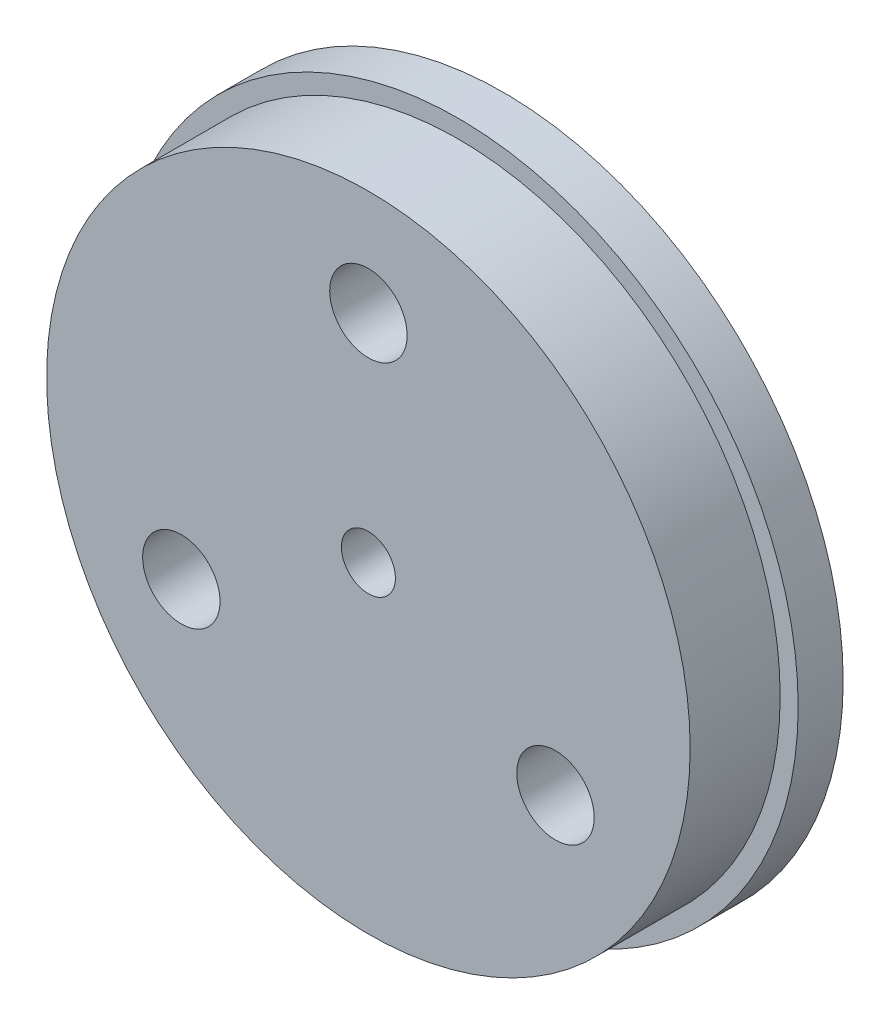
ISO-10303-21;
HEADER;
FILE_DESCRIPTION(('STEP AP214'),'2;1');
FILE_NAME('part.step','',(''),(''),'','','');
FILE_SCHEMA(('AUTOMOTIVE_DESIGN { 1 0 10303 214 1 1 1 1 }'));
ENDSEC;
DATA;
#1=APPLICATION_CONTEXT('core data for automotive mechanical design processes');
#2=APPLICATION_PROTOCOL_DEFINITION('international standard','automotive_design',2000,#1);
#3=PRODUCT_CONTEXT('',#1,'mechanical');
#4=PRODUCT('Part','Part','',(#3));
#5=PRODUCT_RELATED_PRODUCT_CATEGORY('part','',(#4));
#6=PRODUCT_DEFINITION_FORMATION('','',#4);
#7=PRODUCT_DEFINITION_CONTEXT('part definition',#1,'design');
#8=PRODUCT_DEFINITION('design','',#6,#7);
#9=PRODUCT_DEFINITION_SHAPE('','',#8);
#10=(LENGTH_UNIT() NAMED_UNIT(*) SI_UNIT(.MILLI.,.METRE.));
#11=(NAMED_UNIT(*) PLANE_ANGLE_UNIT() SI_UNIT($,.RADIAN.));
#12=(NAMED_UNIT(*) SI_UNIT($,.STERADIAN.) SOLID_ANGLE_UNIT());
#13=UNCERTAINTY_MEASURE_WITH_UNIT(LENGTH_MEASURE(1.E-05),#10,'distance_accuracy_value','');
#14=(GEOMETRIC_REPRESENTATION_CONTEXT(3) GLOBAL_UNCERTAINTY_ASSIGNED_CONTEXT((#13)) GLOBAL_UNIT_ASSIGNED_CONTEXT((#10,
#11,#12)) REPRESENTATION_CONTEXT('',''));
#15=CARTESIAN_POINT('',(0.,0.,0.));
#16=DIRECTION('',(0.,0.,1.));
#17=DIRECTION('',(1.,0.,0.));
#18=AXIS2_PLACEMENT_3D('',#15,#16,#17);
#19=CARTESIAN_POINT('',(0.,24.,5.));
#20=DIRECTION('',(0.,0.,-1.));
#21=DIRECTION('',(-1.,0.,0.));
#22=AXIS2_PLACEMENT_3D('',#19,#20,#21);
#23=CYLINDRICAL_SURFACE('',#22,4.3);
#24=CARTESIAN_POINT('',(0.,24.,15.));
#25=DIRECTION('',(0.,0.,1.));
#26=DIRECTION('',(1.,0.,0.));
#27=AXIS2_PLACEMENT_3D('',#24,#25,#26);
#28=CIRCLE('',#27,4.3);
#29=CARTESIAN_POINT('',(4.3,24.,15.));
#30=VERTEX_POINT('',#29);
#31=EDGE_CURVE('E210',#30,#30,#28,.T.);
#32=ORIENTED_EDGE('',*,*,#31,.T.);
#33=EDGE_LOOP('',(#32));
#34=FACE_BOUND('',#33,.T.);
#35=CARTESIAN_POINT('',(0.,24.,1.5));
#36=DIRECTION('',(0.,0.,-1.));
#37=DIRECTION('',(-1.,0.,0.));
#38=AXIS2_PLACEMENT_3D('',#35,#36,#37);
#39=CIRCLE('',#38,4.3);
#40=CARTESIAN_POINT('',(-4.3,24.,1.5));
#41=VERTEX_POINT('',#40);
#42=EDGE_CURVE('E368',#41,#41,#39,.T.);
#43=ORIENTED_EDGE('',*,*,#42,.T.);
#44=EDGE_LOOP('',(#43));
#45=FACE_BOUND('',#44,.T.);
#46=ADVANCED_FACE('F42',(#34,#45),#23,.F.);
#47=CARTESIAN_POINT('',(20.7846096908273,-11.9999999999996,5.));
#48=DIRECTION('',(0.,0.,-1.));
#49=DIRECTION('',(-1.,0.,0.));
#50=AXIS2_PLACEMENT_3D('',#47,#48,#49);
#51=CYLINDRICAL_SURFACE('',#50,4.3);
#52=CARTESIAN_POINT('',(20.7846096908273,-11.9999999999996,15.));
#53=DIRECTION('',(0.,0.,1.));
#54=DIRECTION('',(1.,0.,0.));
#55=AXIS2_PLACEMENT_3D('',#52,#53,#54);
#56=CIRCLE('',#55,4.3);
#57=CARTESIAN_POINT('',(25.0846096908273,-11.9999999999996,15.));
#58=VERTEX_POINT('',#57);
#59=EDGE_CURVE('E279',#58,#58,#56,.T.);
#60=ORIENTED_EDGE('',*,*,#59,.T.);
#61=EDGE_LOOP('',(#60));
#62=FACE_BOUND('',#61,.T.);
#63=CARTESIAN_POINT('',(20.7846096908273,-11.9999999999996,1.5));
#64=DIRECTION('',(0.,0.,-1.));
#65=DIRECTION('',(-1.,0.,0.));
#66=AXIS2_PLACEMENT_3D('',#63,#64,#65);
#67=CIRCLE('',#66,4.3);
#68=CARTESIAN_POINT('',(16.4846096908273,-11.9999999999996,1.5));
#69=VERTEX_POINT('',#68);
#70=EDGE_CURVE('E359',#69,#69,#67,.T.);
#71=ORIENTED_EDGE('',*,*,#70,.T.);
#72=EDGE_LOOP('',(#71));
#73=FACE_BOUND('',#72,.T.);
#74=ADVANCED_FACE('F402',(#62,#73),#51,.F.);
#75=CARTESIAN_POINT('',(-20.7846096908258,-12.0000000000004,5.));
#76=DIRECTION('',(0.,0.,-1.));
#77=DIRECTION('',(-1.,0.,0.));
#78=AXIS2_PLACEMENT_3D('',#75,#76,#77);
#79=CYLINDRICAL_SURFACE('',#78,4.3);
#80=CARTESIAN_POINT('',(-20.7846096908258,-12.0000000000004,15.));
#81=DIRECTION('',(0.,0.,1.));
#82=DIRECTION('',(1.,0.,0.));
#83=AXIS2_PLACEMENT_3D('',#80,#81,#82);
#84=CIRCLE('',#83,4.3);
#85=CARTESIAN_POINT('',(-16.4846096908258,-12.0000000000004,15.));
#86=VERTEX_POINT('',#85);
#87=EDGE_CURVE('E282',#86,#86,#84,.T.);
#88=ORIENTED_EDGE('',*,*,#87,.T.);
#89=EDGE_LOOP('',(#88));
#90=FACE_BOUND('',#89,.T.);
#91=CARTESIAN_POINT('',(-20.7846096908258,-12.0000000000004,1.5));
#92=DIRECTION('',(0.,0.,-1.));
#93=DIRECTION('',(-1.,0.,0.));
#94=AXIS2_PLACEMENT_3D('',#91,#92,#93);
#95=CIRCLE('',#94,4.3);
#96=CARTESIAN_POINT('',(-25.0846096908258,-12.0000000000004,1.5));
#97=VERTEX_POINT('',#96);
#98=EDGE_CURVE('E328',#97,#97,#95,.T.);
#99=ORIENTED_EDGE('',*,*,#98,.T.);
#100=EDGE_LOOP('',(#99));
#101=FACE_BOUND('',#100,.T.);
#102=ADVANCED_FACE('F409',(#90,#101),#79,.F.);
#103=CARTESIAN_POINT('',(-20.7846096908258,-12.0000000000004,3.));
#104=DIRECTION('',(0.,0.,-1.));
#105=DIRECTION('',(-1.,0.,0.));
#106=AXIS2_PLACEMENT_3D('',#103,#104,#105);
#107=CYLINDRICAL_SURFACE('',#106,8.5);
#108=CARTESIAN_POINT('',(-20.7846096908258,-12.0000000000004,1.5));
#109=DIRECTION('',(0.,0.,-1.));
#110=DIRECTION('',(-1.,0.,0.));
#111=AXIS2_PLACEMENT_3D('',#108,#109,#110);
#112=CIRCLE('',#111,8.5);
#113=CARTESIAN_POINT('',(-29.161889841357,-13.439158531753,1.5));
#114=VERTEX_POINT('',#113);
#115=CARTESIAN_POINT('',(-23.656603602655,-3.99989681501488,1.5));
#116=VERTEX_POINT('',#115);
#117=EDGE_CURVE('E310',#114,#116,#112,.T.);
#118=ORIENTED_EDGE('',*,*,#117,.F.);
#119=DIRECTION('',(0.,0.,-1.));
#120=VECTOR('',#119,1.);
#121=CARTESIAN_POINT('',(-29.161889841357,-13.439158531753,3.));
#122=LINE('',#121,#120);
#123=CARTESIAN_POINT('',(-29.161889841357,-13.439158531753,3.));
#124=VERTEX_POINT('',#123);
#125=EDGE_CURVE('E246',#124,#114,#122,.T.);
#126=ORIENTED_EDGE('',*,*,#125,.F.);
#127=CARTESIAN_POINT('',(-20.7846096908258,-12.0000000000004,3.));
#128=DIRECTION('',(0.,0.,1.));
#129=DIRECTION('',(-1.,0.,0.));
#130=AXIS2_PLACEMENT_3D('',#127,#128,#129);
#131=CIRCLE('',#130,8.5);
#132=CARTESIAN_POINT('',(-23.656603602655,-3.99989681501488,3.));
#133=VERTEX_POINT('',#132);
#134=EDGE_CURVE('E263',#133,#124,#131,.T.);
#135=ORIENTED_EDGE('',*,*,#134,.F.);
#136=DIRECTION('',(0.,0.,-1.));
#137=VECTOR('',#136,1.);
#138=CARTESIAN_POINT('',(-23.656603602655,-3.99989681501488,3.));
#139=LINE('',#138,#137);
#140=EDGE_CURVE('E255',#133,#116,#139,.T.);
#141=ORIENTED_EDGE('',*,*,#140,.T.);
#142=EDGE_LOOP('',(#118,#126,#135,#141));
#143=FACE_BOUND('',#142,.T.);
#144=ADVANCED_FACE('F314',(#143),#107,.T.);
#145=CARTESIAN_POINT('',(-1.74339709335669E-12,24.,3.));
#146=DIRECTION('',(0.,0.,-1.));
#147=DIRECTION('',(-1.,0.,0.));
#148=AXIS2_PLACEMENT_3D('',#145,#146,#147);
#149=CYLINDRICAL_SURFACE('',#148,8.54882869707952);
#150=CARTESIAN_POINT('',(-1.74339709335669E-12,24.,1.5));
#151=DIRECTION('',(0.,0.,-1.));
#152=DIRECTION('',(-1.,0.,0.));
#153=AXIS2_PLACEMENT_3D('',#150,#151,#152);
#154=CIRCLE('',#153,8.54882869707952);
#155=CARTESIAN_POINT('',(2.96694632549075,32.0174622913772,1.5));
#156=VERTEX_POINT('',#155);
#157=CARTESIAN_POINT('',(8.4204210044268,22.5238624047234,1.5));
#158=VERTEX_POINT('',#157);
#159=EDGE_CURVE('E358',#156,#158,#154,.T.);
#160=ORIENTED_EDGE('',*,*,#159,.F.);
#161=DIRECTION('',(0.,0.,-1.));
#162=VECTOR('',#161,1.);
#163=CARTESIAN_POINT('',(2.96694632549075,32.0174622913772,3.));
#164=LINE('',#163,#162);
#165=CARTESIAN_POINT('',(2.96694632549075,32.0174622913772,3.));
#166=VERTEX_POINT('',#165);
#167=EDGE_CURVE('E217',#166,#156,#164,.T.);
#168=ORIENTED_EDGE('',*,*,#167,.F.);
#169=CARTESIAN_POINT('',(-1.74339709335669E-12,24.,3.));
#170=DIRECTION('',(0.,0.,1.));
#171=DIRECTION('',(-1.,0.,0.));
#172=AXIS2_PLACEMENT_3D('',#169,#170,#171);
#173=CIRCLE('',#172,8.54882869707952);
#174=CARTESIAN_POINT('',(8.4204210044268,22.5238624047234,3.));
#175=VERTEX_POINT('',#174);
#176=EDGE_CURVE('E233',#175,#166,#173,.T.);
#177=ORIENTED_EDGE('',*,*,#176,.F.);
#178=DIRECTION('',(0.,0.,-1.));
#179=VECTOR('',#178,1.);
#180=CARTESIAN_POINT('',(8.4204210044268,22.5238624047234,3.));
#181=LINE('',#180,#179);
#182=EDGE_CURVE('E226',#175,#158,#181,.T.);
#183=ORIENTED_EDGE('',*,*,#182,.T.);
#184=EDGE_LOOP('',(#160,#168,#177,#183));
#185=FACE_BOUND('',#184,.T.);
#186=ADVANCED_FACE('F475',(#185),#149,.T.);
#187=CARTESIAN_POINT('',(20.7846096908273,-11.9999999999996,3.));
#188=DIRECTION('',(0.,0.,-1.));
#189=DIRECTION('',(-1.,0.,0.));
#190=AXIS2_PLACEMENT_3D('',#187,#188,#189);
#191=CYLINDRICAL_SURFACE('',#190,8.5);
#192=CARTESIAN_POINT('',(20.7846096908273,-11.9999999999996,1.5));
#193=DIRECTION('',(0.,0.,-1.));
#194=DIRECTION('',(-1.,0.,0.));
#195=AXIS2_PLACEMENT_3D('',#192,#193,#194);
#196=CIRCLE('',#195,8.5);
#197=CARTESIAN_POINT('',(26.2483043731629,-18.5113777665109,1.5));
#198=VERTEX_POINT('',#197);
#199=CARTESIAN_POINT('',(15.3209150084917,-18.5113777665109,1.5));
#200=VERTEX_POINT('',#199);
#201=EDGE_CURVE('E355',#198,#200,#196,.T.);
#202=ORIENTED_EDGE('',*,*,#201,.F.);
#203=DIRECTION('',(0.,0.,-1.));
#204=VECTOR('',#203,1.);
#205=CARTESIAN_POINT('',(26.2483043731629,-18.5113777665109,3.));
#206=LINE('',#205,#204);
#207=CARTESIAN_POINT('',(26.2483043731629,-18.5113777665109,3.));
#208=VERTEX_POINT('',#207);
#209=EDGE_CURVE('E215',#208,#198,#206,.T.);
#210=ORIENTED_EDGE('',*,*,#209,.F.);
#211=CARTESIAN_POINT('',(20.7846096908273,-11.9999999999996,3.));
#212=DIRECTION('',(0.,0.,1.));
#213=DIRECTION('',(-1.,0.,0.));
#214=AXIS2_PLACEMENT_3D('',#211,#212,#213);
#215=CIRCLE('',#214,8.5);
#216=CARTESIAN_POINT('',(15.3209150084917,-18.5113777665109,3.));
#217=VERTEX_POINT('',#216);
#218=EDGE_CURVE('E206',#217,#208,#215,.T.);
#219=ORIENTED_EDGE('',*,*,#218,.F.);
#220=DIRECTION('',(0.,0.,-1.));
#221=VECTOR('',#220,1.);
#222=CARTESIAN_POINT('',(15.3209150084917,-18.5113777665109,3.));
#223=LINE('',#222,#221);
#224=EDGE_CURVE('E207',#217,#200,#223,.T.);
#225=ORIENTED_EDGE('',*,*,#224,.T.);
#226=EDGE_LOOP('',(#202,#210,#219,#225));
#227=FACE_BOUND('',#226,.T.);
#228=ADVANCED_FACE('F353',(#227),#191,.T.);
#229=CARTESIAN_POINT('',(0.,0.,5.));
#230=DIRECTION('',(0.,0.,1.));
#231=DIRECTION('',(1.,0.,0.));
#232=AXIS2_PLACEMENT_3D('',#229,#230,#231);
#233=PLANE('',#232);
#234=CARTESIAN_POINT('',(0.,0.,5.));
#235=DIRECTION('',(0.,0.,1.));
#236=DIRECTION('',(1.,0.,0.));
#237=AXIS2_PLACEMENT_3D('',#234,#235,#236);
#238=CIRCLE('',#237,35.75);
#239=CARTESIAN_POINT('',(35.75,0.,5.));
#240=VERTEX_POINT('',#239);
#241=EDGE_CURVE('E292',#240,#240,#238,.T.);
#242=ORIENTED_EDGE('',*,*,#241,.F.);
#243=EDGE_LOOP('',(#242));
#244=FACE_BOUND('',#243,.T.);
#245=CARTESIAN_POINT('',(0.,0.,5.));
#246=DIRECTION('',(0.,0.,1.));
#247=DIRECTION('',(1.,0.,0.));
#248=AXIS2_PLACEMENT_3D('',#245,#246,#247);
#249=CIRCLE('',#248,37.75);
#250=CARTESIAN_POINT('',(37.75,0.,5.));
#251=VERTEX_POINT('',#250);
#252=EDGE_CURVE('E295',#251,#251,#249,.T.);
#253=ORIENTED_EDGE('',*,*,#252,.T.);
#254=EDGE_LOOP('',(#253));
#255=FACE_BOUND('',#254,.T.);
#256=ADVANCED_FACE('F420',(#244,#255),#233,.T.);
#257=CARTESIAN_POINT('',(0.,0.,0.));
#258=DIRECTION('',(0.,0.,1.));
#259=DIRECTION('',(1.,0.,0.));
#260=AXIS2_PLACEMENT_3D('',#257,#258,#259);
#261=PLANE('',#260);
#262=DIRECTION('',(0.642787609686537,-0.76604444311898,0.));
#263=VECTOR('',#262,1.);
#264=CARTESIAN_POINT('',(27.3731826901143,-19.8519555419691,0.));
#265=LINE('',#264,#263);
#266=CARTESIAN_POINT('',(26.4090012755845,-18.7028888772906,0.));
#267=VERTEX_POINT('',#266);
#268=CARTESIAN_POINT('',(27.3731826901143,-19.8519555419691,0.));
#269=VERTEX_POINT('',#268);
#270=EDGE_CURVE('E184',#267,#269,#265,.T.);
#271=ORIENTED_EDGE('',*,*,#270,.F.);
#272=CARTESIAN_POINT('',(20.7846096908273,-11.9999999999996,0.));
#273=DIRECTION('',(0.,0.,-1.));
#274=DIRECTION('',(-1.,0.,0.));
#275=AXIS2_PLACEMENT_3D('',#272,#273,#274);
#276=CIRCLE('',#275,8.75);
#277=CARTESIAN_POINT('',(15.1602181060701,-18.7028888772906,0.));
#278=VERTEX_POINT('',#277);
#279=EDGE_CURVE('E167',#278,#267,#276,.T.);
#280=ORIENTED_EDGE('',*,*,#279,.F.);
#281=DIRECTION('',(0.642787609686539,0.766044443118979,0.));
#282=VECTOR('',#281,1.);
#283=CARTESIAN_POINT('',(14.1960366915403,-19.8519555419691,0.));
#284=LINE('',#283,#282);
#285=CARTESIAN_POINT('',(14.1960366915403,-19.8519555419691,0.));
#286=VERTEX_POINT('',#285);
#287=EDGE_CURVE('E197',#286,#278,#284,.T.);
#288=ORIENTED_EDGE('',*,*,#287,.F.);
#289=CARTESIAN_POINT('',(20.7846096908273,-11.9999999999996,0.));
#290=DIRECTION('',(0.,0.,-1.));
#291=DIRECTION('',(-1.,0.,0.));
#292=AXIS2_PLACEMENT_3D('',#289,#290,#291);
#293=CIRCLE('',#292,10.25);
#294=EDGE_CURVE('E194',#269,#286,#293,.T.);
#295=ORIENTED_EDGE('',*,*,#294,.F.);
#296=EDGE_LOOP('',(#271,#280,#288,#295));
#297=FACE_BOUND('',#296,.T.);
#298=DIRECTION('',(0.342020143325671,0.939692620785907,0.));
#299=VECTOR('',#298,1.);
#300=CARTESIAN_POINT('',(3.554535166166,33.631849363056,0.));
#301=LINE('',#300,#299);
#302=CARTESIAN_POINT('',(3.03575193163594,32.206504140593,0.));
#303=VERTEX_POINT('',#302);
#304=CARTESIAN_POINT('',(3.554535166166,33.631849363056,0.));
#305=VERTEX_POINT('',#304);
#306=EDGE_CURVE('E195',#303,#305,#301,.T.);
#307=ORIENTED_EDGE('',*,*,#306,.F.);
#308=CARTESIAN_POINT('',(-8.79504802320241E-13,24.0000000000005,0.));
#309=DIRECTION('',(0.,0.,-1.));
#310=DIRECTION('',(-1.,0.,0.));
#311=AXIS2_PLACEMENT_3D('',#308,#309,#310);
#312=CIRCLE('',#311,8.75);
#313=CARTESIAN_POINT('',(8.61853615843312,22.4889293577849,0.));
#314=VERTEX_POINT('',#313);
#315=EDGE_CURVE('E180',#314,#303,#312,.T.);
#316=ORIENTED_EDGE('',*,*,#315,.F.);
#317=DIRECTION('',(-0.984807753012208,0.17364817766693,0.));
#318=VECTOR('',#317,1.);
#319=CARTESIAN_POINT('',(10.143108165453,22.2201061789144,0.));
#320=LINE('',#319,#318);
#321=CARTESIAN_POINT('',(10.143108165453,22.2201061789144,0.));
#322=VERTEX_POINT('',#321);
#323=EDGE_CURVE('E230',#322,#314,#320,.T.);
#324=ORIENTED_EDGE('',*,*,#323,.F.);
#325=CARTESIAN_POINT('',(0.0488286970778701,24.0000000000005,0.));
#326=DIRECTION('',(0.,0.,-1.));
#327=DIRECTION('',(-1.,0.,0.));
#328=AXIS2_PLACEMENT_3D('',#325,#326,#327);
#329=CIRCLE('',#328,10.25);
#330=EDGE_CURVE('E199',#305,#322,#329,.T.);
#331=ORIENTED_EDGE('',*,*,#330,.F.);
#332=EDGE_LOOP('',(#307,#316,#324,#331));
#333=FACE_BOUND('',#332,.T.);
#334=DIRECTION('',(-0.984807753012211,-0.173648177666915,0.));
#335=VECTOR('',#334,1.);
#336=CARTESIAN_POINT('',(-30.8544748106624,-13.7376069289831,0.));
#337=LINE('',#336,#335);
#338=CARTESIAN_POINT('',(-29.4080940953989,-13.4825709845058,0.));
#339=VERTEX_POINT('',#338);
#340=CARTESIAN_POINT('',(-30.8544748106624,-13.7376069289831,0.));
#341=VERTEX_POINT('',#340);
#342=EDGE_CURVE('E229',#339,#341,#337,.T.);
#343=ORIENTED_EDGE('',*,*,#342,.F.);
#344=CARTESIAN_POINT('',(-20.7846096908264,-12.0000000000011,0.));
#345=DIRECTION('',(0.,0.,-1.));
#346=DIRECTION('',(-1.,0.,0.));
#347=AXIS2_PLACEMENT_3D('',#344,#345,#346);
#348=CIRCLE('',#347,8.75);
#349=CARTESIAN_POINT('',(-23.742109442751,-3.76497145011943,0.));
#350=VERTEX_POINT('',#349);
#351=EDGE_CURVE('E382',#350,#339,#348,.T.);
#352=ORIENTED_EDGE('',*,*,#351,.F.);
#353=DIRECTION('',(0.342020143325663,-0.93969262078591,0.));
#354=VECTOR('',#353,1.);
#355=CARTESIAN_POINT('',(-24.2659018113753,-2.32586374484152,0.));
#356=LINE('',#355,#354);
#357=CARTESIAN_POINT('',(-24.2659018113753,-2.32586374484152,0.));
#358=VERTEX_POINT('',#357);
#359=EDGE_CURVE('E259',#358,#350,#356,.T.);
#360=ORIENTED_EDGE('',*,*,#359,.F.);
#361=CARTESIAN_POINT('',(-20.7601953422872,-11.9577131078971,0.));
#362=DIRECTION('',(0.,0.,-1.));
#363=DIRECTION('',(-1.,0.,0.));
#364=AXIS2_PLACEMENT_3D('',#361,#362,#363);
#365=CIRCLE('',#364,10.25);
#366=EDGE_CURVE('E262',#341,#358,#365,.T.);
#367=ORIENTED_EDGE('',*,*,#366,.F.);
#368=EDGE_LOOP('',(#343,#352,#360,#367));
#369=FACE_BOUND('',#368,.T.);
#370=CARTESIAN_POINT('',(0.,0.,0.));
#371=DIRECTION('',(0.,0.,1.));
#372=DIRECTION('',(1.,0.,0.));
#373=AXIS2_PLACEMENT_3D('',#370,#371,#372);
#374=CIRCLE('',#373,37.75);
#375=CARTESIAN_POINT('',(37.75,0.,0.));
#376=VERTEX_POINT('',#375);
#377=EDGE_CURVE('E298',#376,#376,#374,.T.);
#378=ORIENTED_EDGE('',*,*,#377,.F.);
#379=EDGE_LOOP('',(#378));
#380=FACE_BOUND('',#379,.T.);
#381=CARTESIAN_POINT('',(0.,0.,0.));
#382=DIRECTION('',(0.,0.,1.));
#383=DIRECTION('',(1.,0.,0.));
#384=AXIS2_PLACEMENT_3D('',#381,#382,#383);
#385=CIRCLE('',#384,3.);
#386=CARTESIAN_POINT('',(3.,0.,0.));
#387=VERTEX_POINT('',#386);
#388=EDGE_CURVE('E291',#387,#387,#385,.T.);
#389=ORIENTED_EDGE('',*,*,#388,.T.);
#390=EDGE_LOOP('',(#389));
#391=FACE_BOUND('',#390,.T.);
#392=ADVANCED_FACE('F191',(#297,#333,#369,#380,#391),#261,.F.);
#393=CARTESIAN_POINT('',(0.,0.,5.));
#394=DIRECTION('',(0.,0.,-1.));
#395=DIRECTION('',(-1.,0.,0.));
#396=AXIS2_PLACEMENT_3D('',#393,#394,#395);
#397=CYLINDRICAL_SURFACE('',#396,37.75);
#398=ORIENTED_EDGE('',*,*,#252,.F.);
#399=EDGE_LOOP('',(#398));
#400=FACE_BOUND('',#399,.T.);
#401=ORIENTED_EDGE('',*,*,#377,.T.);
#402=EDGE_LOOP('',(#401));
#403=FACE_BOUND('',#402,.T.);
#404=ADVANCED_FACE('F44',(#400,#403),#397,.T.);
#405=CARTESIAN_POINT('',(0.,0.,5.));
#406=DIRECTION('',(0.,0.,-1.));
#407=DIRECTION('',(-1.,0.,0.));
#408=AXIS2_PLACEMENT_3D('',#405,#406,#407);
#409=CYLINDRICAL_SURFACE('',#408,3.);
#410=ORIENTED_EDGE('',*,*,#388,.F.);
#411=EDGE_LOOP('',(#410));
#412=FACE_BOUND('',#411,.T.);
#413=CARTESIAN_POINT('',(0.,0.,15.));
#414=DIRECTION('',(0.,0.,1.));
#415=DIRECTION('',(1.,0.,0.));
#416=AXIS2_PLACEMENT_3D('',#413,#414,#415);
#417=CIRCLE('',#416,3.);
#418=CARTESIAN_POINT('',(3.,0.,15.));
#419=VERTEX_POINT('',#418);
#420=EDGE_CURVE('E285',#419,#419,#417,.T.);
#421=ORIENTED_EDGE('',*,*,#420,.T.);
#422=EDGE_LOOP('',(#421));
#423=FACE_BOUND('',#422,.T.);
#424=ADVANCED_FACE('F415',(#412,#423),#409,.F.);
#425=CARTESIAN_POINT('',(0.,0.,15.));
#426=DIRECTION('',(0.,0.,1.));
#427=DIRECTION('',(1.,0.,0.));
#428=AXIS2_PLACEMENT_3D('',#425,#426,#427);
#429=PLANE('',#428);
#430=ORIENTED_EDGE('',*,*,#59,.F.);
#431=EDGE_LOOP('',(#430));
#432=FACE_BOUND('',#431,.T.);
#433=ORIENTED_EDGE('',*,*,#420,.F.);
#434=EDGE_LOOP('',(#433));
#435=FACE_BOUND('',#434,.T.);
#436=CARTESIAN_POINT('',(0.,0.,15.));
#437=DIRECTION('',(0.,0.,1.));
#438=DIRECTION('',(1.,0.,0.));
#439=AXIS2_PLACEMENT_3D('',#436,#437,#438);
#440=CIRCLE('',#439,35.75);
#441=CARTESIAN_POINT('',(35.75,0.,15.));
#442=VERTEX_POINT('',#441);
#443=EDGE_CURVE('E288',#442,#442,#440,.T.);
#444=ORIENTED_EDGE('',*,*,#443,.T.);
#445=EDGE_LOOP('',(#444));
#446=FACE_BOUND('',#445,.T.);
#447=ORIENTED_EDGE('',*,*,#87,.F.);
#448=EDGE_LOOP('',(#447));
#449=FACE_BOUND('',#448,.T.);
#450=ORIENTED_EDGE('',*,*,#31,.F.);
#451=EDGE_LOOP('',(#450));
#452=FACE_BOUND('',#451,.T.);
#453=ADVANCED_FACE('F418',(#432,#435,#446,#449,#452),#429,.T.);
#454=CARTESIAN_POINT('',(0.,0.,15.));
#455=DIRECTION('',(0.,0.,-1.));
#456=DIRECTION('',(-1.,0.,0.));
#457=AXIS2_PLACEMENT_3D('',#454,#455,#456);
#458=CYLINDRICAL_SURFACE('',#457,35.75);
#459=ORIENTED_EDGE('',*,*,#443,.F.);
#460=EDGE_LOOP('',(#459));
#461=FACE_BOUND('',#460,.T.);
#462=ORIENTED_EDGE('',*,*,#241,.T.);
#463=EDGE_LOOP('',(#462));
#464=FACE_BOUND('',#463,.T.);
#465=ADVANCED_FACE('F443',(#461,#464),#458,.T.);
#466=CARTESIAN_POINT('',(-24.2659018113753,-2.32586374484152,3.));
#467=DIRECTION('',(0.93969262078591,0.342020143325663,0.));
#468=DIRECTION('',(-0.342020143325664,0.93969262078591,0.));
#469=AXIS2_PLACEMENT_3D('',#466,#467,#468);
#470=PLANE('',#469);
#471=ORIENTED_EDGE('',*,*,#359,.T.);
#472=DIRECTION('',(0.,0.,-1.));
#473=VECTOR('',#472,1.);
#474=CARTESIAN_POINT('',(-23.742109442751,-3.76497145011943,1.5));
#475=LINE('',#474,#473);
#476=CARTESIAN_POINT('',(-23.742109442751,-3.76497145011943,1.5));
#477=VERTEX_POINT('',#476);
#478=EDGE_CURVE('E258',#350,#477,#475,.F.);
#479=ORIENTED_EDGE('',*,*,#478,.T.);
#480=DIRECTION('',(-0.342020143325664,0.93969262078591,0.));
#481=VECTOR('',#480,1.);
#482=CARTESIAN_POINT('',(-24.2659018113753,-2.32586374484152,1.5));
#483=LINE('',#482,#481);
#484=EDGE_CURVE('E317',#116,#477,#483,.T.);
#485=ORIENTED_EDGE('',*,*,#484,.F.);
#486=ORIENTED_EDGE('',*,*,#140,.F.);
#487=DIRECTION('',(0.342020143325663,-0.93969262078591,0.));
#488=VECTOR('',#487,1.);
#489=CARTESIAN_POINT('',(-24.2659018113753,-2.32586374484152,3.));
#490=LINE('',#489,#488);
#491=CARTESIAN_POINT('',(-24.2659018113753,-2.32586374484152,3.));
#492=VERTEX_POINT('',#491);
#493=EDGE_CURVE('E249',#492,#133,#490,.T.);
#494=ORIENTED_EDGE('',*,*,#493,.F.);
#495=DIRECTION('',(0.,0.,-1.));
#496=VECTOR('',#495,1.);
#497=CARTESIAN_POINT('',(-24.2659018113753,-2.32586374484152,3.));
#498=LINE('',#497,#496);
#499=EDGE_CURVE('E253',#492,#358,#498,.T.);
#500=ORIENTED_EDGE('',*,*,#499,.T.);
#501=EDGE_LOOP('',(#471,#479,#485,#486,#494,#500));
#502=FACE_BOUND('',#501,.T.);
#503=ADVANCED_FACE('F326',(#502),#470,.F.);
#504=CARTESIAN_POINT('',(-20.7601953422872,-11.9577131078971,3.));
#505=DIRECTION('',(0.,0.,-1.));
#506=DIRECTION('',(-1.,0.,0.));
#507=AXIS2_PLACEMENT_3D('',#504,#505,#506);
#508=CYLINDRICAL_SURFACE('',#507,10.25);
#509=ORIENTED_EDGE('',*,*,#366,.T.);
#510=ORIENTED_EDGE('',*,*,#499,.F.);
#511=CARTESIAN_POINT('',(-20.7601953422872,-11.9577131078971,3.));
#512=DIRECTION('',(0.,0.,-1.));
#513=DIRECTION('',(-1.,0.,0.));
#514=AXIS2_PLACEMENT_3D('',#511,#512,#513);
#515=CIRCLE('',#514,10.25);
#516=CARTESIAN_POINT('',(-30.8544748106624,-13.7376069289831,3.));
#517=VERTEX_POINT('',#516);
#518=EDGE_CURVE('E269',#517,#492,#515,.T.);
#519=ORIENTED_EDGE('',*,*,#518,.F.);
#520=DIRECTION('',(0.,0.,-1.));
#521=VECTOR('',#520,1.);
#522=CARTESIAN_POINT('',(-30.8544748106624,-13.7376069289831,3.));
#523=LINE('',#522,#521);
#524=EDGE_CURVE('E250',#517,#341,#523,.T.);
#525=ORIENTED_EDGE('',*,*,#524,.T.);
#526=EDGE_LOOP('',(#509,#510,#519,#525));
#527=FACE_BOUND('',#526,.T.);
#528=ADVANCED_FACE('F496',(#527),#508,.F.);
#529=CARTESIAN_POINT('',(-30.8544748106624,-13.7376069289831,3.));
#530=DIRECTION('',(0.173648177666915,-0.984807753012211,0.));
#531=DIRECTION('',(0.984807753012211,0.173648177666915,0.));
#532=AXIS2_PLACEMENT_3D('',#529,#530,#531);
#533=PLANE('',#532);
#534=DIRECTION('',(0.984807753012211,0.173648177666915,0.));
#535=VECTOR('',#534,1.);
#536=CARTESIAN_POINT('',(-30.8544748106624,-13.7376069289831,1.5));
#537=LINE('',#536,#535);
#538=CARTESIAN_POINT('',(-29.4080940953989,-13.4825709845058,1.5));
#539=VERTEX_POINT('',#538);
#540=EDGE_CURVE('E50',#539,#114,#537,.T.);
#541=ORIENTED_EDGE('',*,*,#540,.F.);
#542=DIRECTION('',(0.,0.,-1.));
#543=VECTOR('',#542,1.);
#544=CARTESIAN_POINT('',(-29.4080940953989,-13.4825709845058,1.5));
#545=LINE('',#544,#543);
#546=EDGE_CURVE('E11',#539,#339,#545,.T.);
#547=ORIENTED_EDGE('',*,*,#546,.T.);
#548=ORIENTED_EDGE('',*,*,#342,.T.);
#549=ORIENTED_EDGE('',*,*,#524,.F.);
#550=DIRECTION('',(-0.984807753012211,-0.173648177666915,0.));
#551=VECTOR('',#550,1.);
#552=CARTESIAN_POINT('',(-30.8544748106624,-13.7376069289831,3.));
#553=LINE('',#552,#551);
#554=EDGE_CURVE('E272',#124,#517,#553,.T.);
#555=ORIENTED_EDGE('',*,*,#554,.F.);
#556=ORIENTED_EDGE('',*,*,#125,.T.);
#557=EDGE_LOOP('',(#541,#547,#548,#549,#555,#556));
#558=FACE_BOUND('',#557,.T.);
#559=ADVANCED_FACE('F320',(#558),#533,.F.);
#560=CARTESIAN_POINT('',(-20.7846096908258,-12.0000000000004,3.));
#561=DIRECTION('',(0.,0.,-1.));
#562=DIRECTION('',(-1.,0.,0.));
#563=AXIS2_PLACEMENT_3D('',#560,#561,#562);
#564=PLANE('',#563);
#565=ORIENTED_EDGE('',*,*,#134,.T.);
#566=ORIENTED_EDGE('',*,*,#554,.T.);
#567=ORIENTED_EDGE('',*,*,#518,.T.);
#568=ORIENTED_EDGE('',*,*,#493,.T.);
#569=EDGE_LOOP('',(#565,#566,#567,#568));
#570=FACE_BOUND('',#569,.T.);
#571=ADVANCED_FACE('F323',(#570),#564,.T.);
#572=CARTESIAN_POINT('',(10.143108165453,22.2201061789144,3.));
#573=DIRECTION('',(-0.17364817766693,-0.984807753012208,0.));
#574=DIRECTION('',(0.984807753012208,-0.17364817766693,0.));
#575=AXIS2_PLACEMENT_3D('',#572,#573,#574);
#576=PLANE('',#575);
#577=ORIENTED_EDGE('',*,*,#323,.T.);
#578=DIRECTION('',(0.,0.,-1.));
#579=VECTOR('',#578,1.);
#580=CARTESIAN_POINT('',(8.61853615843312,22.4889293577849,1.5));
#581=LINE('',#580,#579);
#582=CARTESIAN_POINT('',(8.61853615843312,22.4889293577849,1.5));
#583=VERTEX_POINT('',#582);
#584=EDGE_CURVE('E318',#314,#583,#581,.F.);
#585=ORIENTED_EDGE('',*,*,#584,.T.);
#586=DIRECTION('',(0.984807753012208,-0.17364817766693,0.));
#587=VECTOR('',#586,1.);
#588=CARTESIAN_POINT('',(10.143108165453,22.2201061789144,1.5));
#589=LINE('',#588,#587);
#590=EDGE_CURVE('E361',#158,#583,#589,.T.);
#591=ORIENTED_EDGE('',*,*,#590,.F.);
#592=ORIENTED_EDGE('',*,*,#182,.F.);
#593=DIRECTION('',(-0.984807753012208,0.17364817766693,0.));
#594=VECTOR('',#593,1.);
#595=CARTESIAN_POINT('',(10.143108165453,22.2201061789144,3.));
#596=LINE('',#595,#594);
#597=CARTESIAN_POINT('',(10.143108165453,22.2201061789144,3.));
#598=VERTEX_POINT('',#597);
#599=EDGE_CURVE('E220',#598,#175,#596,.T.);
#600=ORIENTED_EDGE('',*,*,#599,.F.);
#601=DIRECTION('',(0.,0.,-1.));
#602=VECTOR('',#601,1.);
#603=CARTESIAN_POINT('',(10.143108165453,22.2201061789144,3.));
#604=LINE('',#603,#602);
#605=EDGE_CURVE('E224',#598,#322,#604,.T.);
#606=ORIENTED_EDGE('',*,*,#605,.T.);
#607=EDGE_LOOP('',(#577,#585,#591,#592,#600,#606));
#608=FACE_BOUND('',#607,.T.);
#609=ADVANCED_FACE('F373',(#608),#576,.F.);
#610=CARTESIAN_POINT('',(0.0488286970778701,24.0000000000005,3.));
#611=DIRECTION('',(0.,0.,-1.));
#612=DIRECTION('',(-1.,0.,0.));
#613=AXIS2_PLACEMENT_3D('',#610,#611,#612);
#614=CYLINDRICAL_SURFACE('',#613,10.25);
#615=ORIENTED_EDGE('',*,*,#330,.T.);
#616=ORIENTED_EDGE('',*,*,#605,.F.);
#617=CARTESIAN_POINT('',(0.0488286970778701,24.0000000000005,3.));
#618=DIRECTION('',(0.,0.,-1.));
#619=DIRECTION('',(-1.,0.,0.));
#620=AXIS2_PLACEMENT_3D('',#617,#618,#619);
#621=CIRCLE('',#620,10.25);
#622=CARTESIAN_POINT('',(3.554535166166,33.631849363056,3.));
#623=VERTEX_POINT('',#622);
#624=EDGE_CURVE('E238',#623,#598,#621,.T.);
#625=ORIENTED_EDGE('',*,*,#624,.F.);
#626=DIRECTION('',(0.,0.,-1.));
#627=VECTOR('',#626,1.);
#628=CARTESIAN_POINT('',(3.554535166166,33.631849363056,3.));
#629=LINE('',#628,#627);
#630=EDGE_CURVE('E221',#623,#305,#629,.T.);
#631=ORIENTED_EDGE('',*,*,#630,.T.);
#632=EDGE_LOOP('',(#615,#616,#625,#631));
#633=FACE_BOUND('',#632,.T.);
#634=ADVANCED_FACE('F482',(#633),#614,.F.);
#635=CARTESIAN_POINT('',(3.554535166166,33.631849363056,3.));
#636=DIRECTION('',(-0.939692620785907,0.342020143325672,0.));
#637=DIRECTION('',(-0.342020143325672,-0.939692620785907,0.));
#638=AXIS2_PLACEMENT_3D('',#635,#636,#637);
#639=PLANE('',#638);
#640=DIRECTION('',(-0.342020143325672,-0.939692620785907,0.));
#641=VECTOR('',#640,1.);
#642=CARTESIAN_POINT('',(3.554535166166,33.631849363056,1.5));
#643=LINE('',#642,#641);
#644=CARTESIAN_POINT('',(3.03575193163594,32.206504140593,1.5));
#645=VERTEX_POINT('',#644);
#646=EDGE_CURVE('E188',#645,#156,#643,.T.);
#647=ORIENTED_EDGE('',*,*,#646,.F.);
#648=DIRECTION('',(0.,0.,-1.));
#649=VECTOR('',#648,1.);
#650=CARTESIAN_POINT('',(3.03575193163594,32.206504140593,1.5));
#651=LINE('',#650,#649);
#652=EDGE_CURVE('E305',#645,#303,#651,.T.);
#653=ORIENTED_EDGE('',*,*,#652,.T.);
#654=ORIENTED_EDGE('',*,*,#306,.T.);
#655=ORIENTED_EDGE('',*,*,#630,.F.);
#656=DIRECTION('',(0.342020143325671,0.939692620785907,0.));
#657=VECTOR('',#656,1.);
#658=CARTESIAN_POINT('',(3.554535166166,33.631849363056,3.));
#659=LINE('',#658,#657);
#660=EDGE_CURVE('E241',#166,#623,#659,.T.);
#661=ORIENTED_EDGE('',*,*,#660,.F.);
#662=ORIENTED_EDGE('',*,*,#167,.T.);
#663=EDGE_LOOP('',(#647,#653,#654,#655,#661,#662));
#664=FACE_BOUND('',#663,.T.);
#665=ADVANCED_FACE('F479',(#664),#639,.F.);
#666=CARTESIAN_POINT('',(-1.74339709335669E-12,24.,3.));
#667=DIRECTION('',(0.,0.,-1.));
#668=DIRECTION('',(-1.,0.,0.));
#669=AXIS2_PLACEMENT_3D('',#666,#667,#668);
#670=PLANE('',#669);
#671=ORIENTED_EDGE('',*,*,#176,.T.);
#672=ORIENTED_EDGE('',*,*,#660,.T.);
#673=ORIENTED_EDGE('',*,*,#624,.T.);
#674=ORIENTED_EDGE('',*,*,#599,.T.);
#675=EDGE_LOOP('',(#671,#672,#673,#674));
#676=FACE_BOUND('',#675,.T.);
#677=ADVANCED_FACE('F469',(#676),#670,.T.);
#678=CARTESIAN_POINT('',(14.1960366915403,-19.8519555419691,3.));
#679=DIRECTION('',(-0.766044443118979,0.642787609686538,0.));
#680=DIRECTION('',(-0.642787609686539,-0.766044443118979,0.));
#681=AXIS2_PLACEMENT_3D('',#678,#679,#680);
#682=PLANE('',#681);
#683=ORIENTED_EDGE('',*,*,#287,.T.);
#684=DIRECTION('',(0.,0.,-1.));
#685=VECTOR('',#684,1.);
#686=CARTESIAN_POINT('',(15.1602181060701,-18.7028888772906,1.5));
#687=LINE('',#686,#685);
#688=CARTESIAN_POINT('',(15.1602181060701,-18.7028888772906,1.5));
#689=VERTEX_POINT('',#688);
#690=EDGE_CURVE('E174',#278,#689,#687,.F.);
#691=ORIENTED_EDGE('',*,*,#690,.T.);
#692=DIRECTION('',(-0.642787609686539,-0.766044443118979,0.));
#693=VECTOR('',#692,1.);
#694=CARTESIAN_POINT('',(14.1960366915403,-19.8519555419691,1.5));
#695=LINE('',#694,#693);
#696=EDGE_CURVE('E350',#200,#689,#695,.T.);
#697=ORIENTED_EDGE('',*,*,#696,.F.);
#698=ORIENTED_EDGE('',*,*,#224,.F.);
#699=DIRECTION('',(0.642787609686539,0.766044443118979,0.));
#700=VECTOR('',#699,1.);
#701=CARTESIAN_POINT('',(14.1960366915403,-19.8519555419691,3.));
#702=LINE('',#701,#700);
#703=CARTESIAN_POINT('',(14.1960366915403,-19.8519555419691,3.));
#704=VERTEX_POINT('',#703);
#705=EDGE_CURVE('E202',#704,#217,#702,.T.);
#706=ORIENTED_EDGE('',*,*,#705,.F.);
#707=DIRECTION('',(0.,0.,-1.));
#708=VECTOR('',#707,1.);
#709=CARTESIAN_POINT('',(14.1960366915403,-19.8519555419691,3.));
#710=LINE('',#709,#708);
#711=EDGE_CURVE('E211',#704,#286,#710,.T.);
#712=ORIENTED_EDGE('',*,*,#711,.T.);
#713=EDGE_LOOP('',(#683,#691,#697,#698,#706,#712));
#714=FACE_BOUND('',#713,.T.);
#715=ADVANCED_FACE('F348',(#714),#682,.F.);
#716=CARTESIAN_POINT('',(20.7846096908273,-11.9999999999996,3.));
#717=DIRECTION('',(0.,0.,-1.));
#718=DIRECTION('',(-1.,0.,0.));
#719=AXIS2_PLACEMENT_3D('',#716,#717,#718);
#720=CYLINDRICAL_SURFACE('',#719,10.25);
#721=ORIENTED_EDGE('',*,*,#294,.T.);
#722=ORIENTED_EDGE('',*,*,#711,.F.);
#723=CARTESIAN_POINT('',(20.7846096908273,-11.9999999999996,3.));
#724=DIRECTION('',(0.,0.,-1.));
#725=DIRECTION('',(-1.,0.,0.));
#726=AXIS2_PLACEMENT_3D('',#723,#724,#725);
#727=CIRCLE('',#726,10.25);
#728=CARTESIAN_POINT('',(27.3731826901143,-19.8519555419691,3.));
#729=VERTEX_POINT('',#728);
#730=EDGE_CURVE('E339',#729,#704,#727,.T.);
#731=ORIENTED_EDGE('',*,*,#730,.F.);
#732=DIRECTION('',(0.,0.,-1.));
#733=VECTOR('',#732,1.);
#734=CARTESIAN_POINT('',(27.3731826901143,-19.8519555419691,3.));
#735=LINE('',#734,#733);
#736=EDGE_CURVE('E213',#729,#269,#735,.T.);
#737=ORIENTED_EDGE('',*,*,#736,.T.);
#738=EDGE_LOOP('',(#721,#722,#731,#737));
#739=FACE_BOUND('',#738,.T.);
#740=ADVANCED_FACE('F357',(#739),#720,.F.);
#741=CARTESIAN_POINT('',(27.3731826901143,-19.8519555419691,3.));
#742=DIRECTION('',(0.76604444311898,0.642787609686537,0.));
#743=DIRECTION('',(-0.642787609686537,0.76604444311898,0.));
#744=AXIS2_PLACEMENT_3D('',#741,#742,#743);
#745=PLANE('',#744);
#746=DIRECTION('',(-0.642787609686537,0.76604444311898,0.));
#747=VECTOR('',#746,1.);
#748=CARTESIAN_POINT('',(27.3731826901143,-19.8519555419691,1.5));
#749=LINE('',#748,#747);
#750=CARTESIAN_POINT('',(26.4090012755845,-18.7028888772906,1.5));
#751=VERTEX_POINT('',#750);
#752=EDGE_CURVE('E187',#751,#198,#749,.T.);
#753=ORIENTED_EDGE('',*,*,#752,.F.);
#754=DIRECTION('',(0.,0.,-1.));
#755=VECTOR('',#754,1.);
#756=CARTESIAN_POINT('',(26.4090012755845,-18.7028888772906,1.5));
#757=LINE('',#756,#755);
#758=EDGE_CURVE('E171',#751,#267,#757,.T.);
#759=ORIENTED_EDGE('',*,*,#758,.T.);
#760=ORIENTED_EDGE('',*,*,#270,.T.);
#761=ORIENTED_EDGE('',*,*,#736,.F.);
#762=DIRECTION('',(0.642787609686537,-0.76604444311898,0.));
#763=VECTOR('',#762,1.);
#764=CARTESIAN_POINT('',(27.3731826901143,-19.8519555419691,3.));
#765=LINE('',#764,#763);
#766=EDGE_CURVE('E337',#208,#729,#765,.T.);
#767=ORIENTED_EDGE('',*,*,#766,.F.);
#768=ORIENTED_EDGE('',*,*,#209,.T.);
#769=EDGE_LOOP('',(#753,#759,#760,#761,#767,#768));
#770=FACE_BOUND('',#769,.T.);
#771=ADVANCED_FACE('F183',(#770),#745,.F.);
#772=CARTESIAN_POINT('',(20.7846096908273,-11.9999999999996,3.));
#773=DIRECTION('',(0.,0.,-1.));
#774=DIRECTION('',(-1.,0.,0.));
#775=AXIS2_PLACEMENT_3D('',#772,#773,#774);
#776=PLANE('',#775);
#777=ORIENTED_EDGE('',*,*,#218,.T.);
#778=ORIENTED_EDGE('',*,*,#766,.T.);
#779=ORIENTED_EDGE('',*,*,#730,.T.);
#780=ORIENTED_EDGE('',*,*,#705,.T.);
#781=EDGE_LOOP('',(#777,#778,#779,#780));
#782=FACE_BOUND('',#781,.T.);
#783=ADVANCED_FACE('F345',(#782),#776,.T.);
#784=CARTESIAN_POINT('',(20.7846096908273,-11.9999999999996,1.5));
#785=DIRECTION('',(0.,0.,-1.));
#786=DIRECTION('',(-1.,0.,0.));
#787=AXIS2_PLACEMENT_3D('',#784,#785,#786);
#788=CYLINDRICAL_SURFACE('',#787,8.75);
#789=ORIENTED_EDGE('',*,*,#279,.T.);
#790=ORIENTED_EDGE('',*,*,#758,.F.);
#791=CARTESIAN_POINT('',(20.7846096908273,-11.9999999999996,1.5));
#792=DIRECTION('',(0.,0.,-1.));
#793=DIRECTION('',(-1.,0.,0.));
#794=AXIS2_PLACEMENT_3D('',#791,#792,#793);
#795=CIRCLE('',#794,8.75);
#796=EDGE_CURVE('E179',#689,#751,#795,.T.);
#797=ORIENTED_EDGE('',*,*,#796,.F.);
#798=ORIENTED_EDGE('',*,*,#690,.F.);
#799=EDGE_LOOP('',(#789,#790,#797,#798));
#800=FACE_BOUND('',#799,.T.);
#801=ADVANCED_FACE('F169',(#800),#788,.F.);
#802=CARTESIAN_POINT('',(20.7846096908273,-11.9999999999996,1.5));
#803=DIRECTION('',(0.,0.,-1.));
#804=DIRECTION('',(-1.,0.,0.));
#805=AXIS2_PLACEMENT_3D('',#802,#803,#804);
#806=PLANE('',#805);
#807=ORIENTED_EDGE('',*,*,#70,.F.);
#808=EDGE_LOOP('',(#807));
#809=FACE_BOUND('',#808,.T.);
#810=ORIENTED_EDGE('',*,*,#696,.T.);
#811=ORIENTED_EDGE('',*,*,#796,.T.);
#812=ORIENTED_EDGE('',*,*,#752,.T.);
#813=ORIENTED_EDGE('',*,*,#201,.T.);
#814=EDGE_LOOP('',(#810,#811,#812,#813));
#815=FACE_BOUND('',#814,.T.);
#816=ADVANCED_FACE('F389',(#809,#815),#806,.T.);
#817=CARTESIAN_POINT('',(-8.79504802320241E-13,24.0000000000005,1.5));
#818=DIRECTION('',(0.,0.,-1.));
#819=DIRECTION('',(-1.,0.,0.));
#820=AXIS2_PLACEMENT_3D('',#817,#818,#819);
#821=CYLINDRICAL_SURFACE('',#820,8.75);
#822=ORIENTED_EDGE('',*,*,#315,.T.);
#823=ORIENTED_EDGE('',*,*,#652,.F.);
#824=CARTESIAN_POINT('',(-8.79504802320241E-13,24.0000000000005,1.5));
#825=DIRECTION('',(0.,0.,-1.));
#826=DIRECTION('',(-1.,0.,0.));
#827=AXIS2_PLACEMENT_3D('',#824,#825,#826);
#828=CIRCLE('',#827,8.75);
#829=EDGE_CURVE('E65',#583,#645,#828,.T.);
#830=ORIENTED_EDGE('',*,*,#829,.F.);
#831=ORIENTED_EDGE('',*,*,#584,.F.);
#832=EDGE_LOOP('',(#822,#823,#830,#831));
#833=FACE_BOUND('',#832,.T.);
#834=ADVANCED_FACE('F377',(#833),#821,.F.);
#835=CARTESIAN_POINT('',(-8.79504802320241E-13,24.0000000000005,1.5));
#836=DIRECTION('',(0.,0.,-1.));
#837=DIRECTION('',(-1.,0.,0.));
#838=AXIS2_PLACEMENT_3D('',#835,#836,#837);
#839=PLANE('',#838);
#840=ORIENTED_EDGE('',*,*,#42,.F.);
#841=EDGE_LOOP('',(#840));
#842=FACE_BOUND('',#841,.T.);
#843=ORIENTED_EDGE('',*,*,#590,.T.);
#844=ORIENTED_EDGE('',*,*,#829,.T.);
#845=ORIENTED_EDGE('',*,*,#646,.T.);
#846=ORIENTED_EDGE('',*,*,#159,.T.);
#847=EDGE_LOOP('',(#843,#844,#845,#846));
#848=FACE_BOUND('',#847,.T.);
#849=ADVANCED_FACE('F397',(#842,#848),#839,.T.);
#850=CARTESIAN_POINT('',(-20.7846096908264,-12.0000000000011,1.5));
#851=DIRECTION('',(0.,0.,-1.));
#852=DIRECTION('',(-1.,0.,0.));
#853=AXIS2_PLACEMENT_3D('',#850,#851,#852);
#854=CYLINDRICAL_SURFACE('',#853,8.75);
#855=ORIENTED_EDGE('',*,*,#351,.T.);
#856=ORIENTED_EDGE('',*,*,#546,.F.);
#857=CARTESIAN_POINT('',(-20.7846096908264,-12.0000000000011,1.5));
#858=DIRECTION('',(0.,0.,-1.));
#859=DIRECTION('',(-1.,0.,0.));
#860=AXIS2_PLACEMENT_3D('',#857,#858,#859);
#861=CIRCLE('',#860,8.75);
#862=EDGE_CURVE('E57',#477,#539,#861,.T.);
#863=ORIENTED_EDGE('',*,*,#862,.F.);
#864=ORIENTED_EDGE('',*,*,#478,.F.);
#865=EDGE_LOOP('',(#855,#856,#863,#864));
#866=FACE_BOUND('',#865,.T.);
#867=ADVANCED_FACE('F457',(#866),#854,.F.);
#868=CARTESIAN_POINT('',(-20.7846096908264,-12.0000000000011,1.5));
#869=DIRECTION('',(0.,0.,-1.));
#870=DIRECTION('',(-1.,0.,0.));
#871=AXIS2_PLACEMENT_3D('',#868,#869,#870);
#872=PLANE('',#871);
#873=ORIENTED_EDGE('',*,*,#98,.F.);
#874=EDGE_LOOP('',(#873));
#875=FACE_BOUND('',#874,.T.);
#876=ORIENTED_EDGE('',*,*,#484,.T.);
#877=ORIENTED_EDGE('',*,*,#862,.T.);
#878=ORIENTED_EDGE('',*,*,#540,.T.);
#879=ORIENTED_EDGE('',*,*,#117,.T.);
#880=EDGE_LOOP('',(#876,#877,#878,#879));
#881=FACE_BOUND('',#880,.T.);
#882=ADVANCED_FACE('F309',(#875,#881),#872,.T.);
#883=CLOSED_SHELL('',(#46,#74,#102,#144,#186,#228,#256,#392,#404,#424,#453,#465,#503,#528,#559,
#571,#609,#634,#665,#677,#715,#740,#771,#783,#801,#816,#834,#849,#867,#882));
#884=MANIFOLD_SOLID_BREP('B2',#883);
#885=ADVANCED_BREP_SHAPE_REPRESENTATION('',(#18,#884),#14);
#886=SHAPE_DEFINITION_REPRESENTATION(#9,#885);
ENDSEC;
END-ISO-10303-21;
